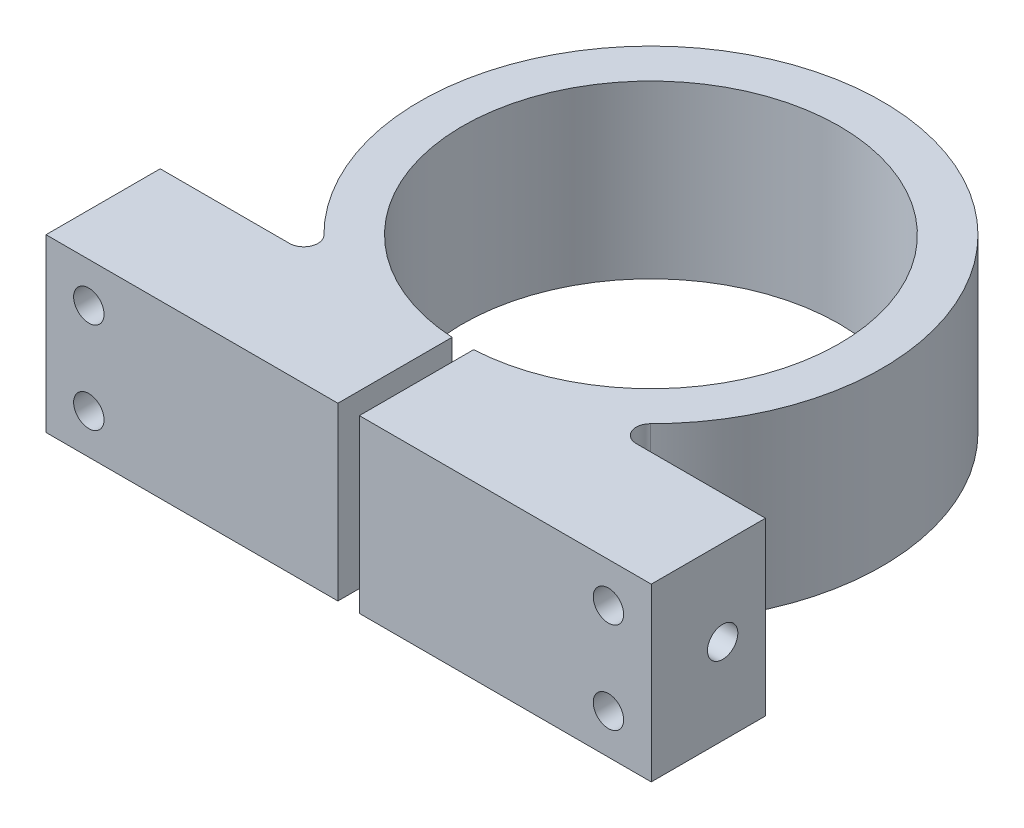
ISO-10303-21;
HEADER;
FILE_DESCRIPTION(('STEP AP214'),'2;1');
FILE_NAME('part.step','',(''),(''),'','','');
FILE_SCHEMA(('AUTOMOTIVE_DESIGN { 1 0 10303 214 1 1 1 1 }'));
ENDSEC;
DATA;
#1=APPLICATION_CONTEXT('core data for automotive mechanical design processes');
#2=APPLICATION_PROTOCOL_DEFINITION('international standard','automotive_design',2000,#1);
#3=PRODUCT_CONTEXT('',#1,'mechanical');
#4=PRODUCT('Part','Part','',(#3));
#5=PRODUCT_RELATED_PRODUCT_CATEGORY('part','',(#4));
#6=PRODUCT_DEFINITION_FORMATION('','',#4);
#7=PRODUCT_DEFINITION_CONTEXT('part definition',#1,'design');
#8=PRODUCT_DEFINITION('design','',#6,#7);
#9=PRODUCT_DEFINITION_SHAPE('','',#8);
#10=(LENGTH_UNIT() NAMED_UNIT(*) SI_UNIT(.MILLI.,.METRE.));
#11=(NAMED_UNIT(*) PLANE_ANGLE_UNIT() SI_UNIT($,.RADIAN.));
#12=(NAMED_UNIT(*) SI_UNIT($,.STERADIAN.) SOLID_ANGLE_UNIT());
#13=UNCERTAINTY_MEASURE_WITH_UNIT(LENGTH_MEASURE(1.E-05),#10,'distance_accuracy_value','');
#14=(GEOMETRIC_REPRESENTATION_CONTEXT(3) GLOBAL_UNCERTAINTY_ASSIGNED_CONTEXT((#13)) GLOBAL_UNIT_ASSIGNED_CONTEXT((#10,
#11,#12)) REPRESENTATION_CONTEXT('',''));
#15=CARTESIAN_POINT('',(0.,0.,0.));
#16=DIRECTION('',(0.,0.,1.));
#17=DIRECTION('',(1.,0.,0.));
#18=AXIS2_PLACEMENT_3D('',#15,#16,#17);
#19=CARTESIAN_POINT('',(-38.5631986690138,38.1,38.66693430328));
#20=DIRECTION('',(0.,-1.,0.));
#21=DIRECTION('',(0.,0.,-1.));
#22=AXIS2_PLACEMENT_3D('',#19,#20,#21);
#23=CYLINDRICAL_SURFACE('',#22,3.175);
#24=CARTESIAN_POINT('',(-38.5631986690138,0.,38.66693430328));
#25=DIRECTION('',(0.,-1.,0.));
#26=DIRECTION('',(0.,0.,1.));
#27=AXIS2_PLACEMENT_3D('',#24,#25,#26);
#28=CIRCLE('',#27,3.175);
#29=CARTESIAN_POINT('',(-36.3211522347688,0.,36.4188567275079));
#30=VERTEX_POINT('',#29);
#31=CARTESIAN_POINT('',(-38.5631986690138,0.,41.84193430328));
#32=VERTEX_POINT('',#31);
#33=EDGE_CURVE('E124',#30,#32,#28,.T.);
#34=ORIENTED_EDGE('',*,*,#33,.T.);
#35=DIRECTION('',(0.,-1.,0.));
#36=VECTOR('',#35,1.);
#37=CARTESIAN_POINT('',(-38.5631986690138,38.1,41.84193430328));
#38=LINE('',#37,#36);
#39=CARTESIAN_POINT('',(-38.5631986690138,38.1,41.84193430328));
#40=VERTEX_POINT('',#39);
#41=EDGE_CURVE('E11',#40,#32,#38,.T.);
#42=ORIENTED_EDGE('',*,*,#41,.F.);
#43=CARTESIAN_POINT('',(-38.5631986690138,38.1,38.66693430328));
#44=DIRECTION('',(0.,-1.,0.));
#45=DIRECTION('',(0.,0.,1.));
#46=AXIS2_PLACEMENT_3D('',#43,#44,#45);
#47=CIRCLE('',#46,3.175);
#48=CARTESIAN_POINT('',(-36.3211522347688,38.1,36.4188567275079));
#49=VERTEX_POINT('',#48);
#50=EDGE_CURVE('E164',#49,#40,#47,.T.);
#51=ORIENTED_EDGE('',*,*,#50,.F.);
#52=DIRECTION('',(0.,-1.,0.));
#53=VECTOR('',#52,1.);
#54=CARTESIAN_POINT('',(-36.3211522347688,38.1,36.4188567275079));
#55=LINE('',#54,#53);
#56=EDGE_CURVE('E137',#49,#30,#55,.T.);
#57=ORIENTED_EDGE('',*,*,#56,.T.);
#58=EDGE_LOOP('',(#34,#42,#51,#57));
#59=FACE_BOUND('',#58,.T.);
#60=ADVANCED_FACE('F32',(#59),#23,.F.);
#61=CARTESIAN_POINT('',(-67.31,38.1,41.84193430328));
#62=DIRECTION('',(0.,0.,1.));
#63=DIRECTION('',(1.,0.,0.));
#64=AXIS2_PLACEMENT_3D('',#61,#62,#63);
#65=PLANE('',#64);
#66=CARTESIAN_POINT('',(-57.785,8.89,41.84193430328));
#67=DIRECTION('',(0.,0.,-1.));
#68=DIRECTION('',(-1.,0.,0.));
#69=AXIS2_PLACEMENT_3D('',#66,#67,#68);
#70=CIRCLE('',#69,3.37819999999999);
#71=CARTESIAN_POINT('',(-61.1632,8.89,41.84193430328));
#72=VERTEX_POINT('',#71);
#73=EDGE_CURVE('E313',#72,#72,#70,.T.);
#74=ORIENTED_EDGE('',*,*,#73,.F.);
#75=EDGE_LOOP('',(#74));
#76=FACE_BOUND('',#75,.T.);
#77=CARTESIAN_POINT('',(-57.785,29.21,41.84193430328));
#78=DIRECTION('',(0.,0.,-1.));
#79=DIRECTION('',(-1.,0.,0.));
#80=AXIS2_PLACEMENT_3D('',#77,#78,#79);
#81=CIRCLE('',#80,3.37819999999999);
#82=CARTESIAN_POINT('',(-61.1632,29.21,41.84193430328));
#83=VERTEX_POINT('',#82);
#84=EDGE_CURVE('E310',#83,#83,#81,.T.);
#85=ORIENTED_EDGE('',*,*,#84,.F.);
#86=EDGE_LOOP('',(#85));
#87=FACE_BOUND('',#86,.T.);
#88=DIRECTION('',(-1.,0.,0.));
#89=VECTOR('',#88,1.);
#90=CARTESIAN_POINT('',(-67.31,0.,41.84193430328));
#91=LINE('',#90,#89);
#92=CARTESIAN_POINT('',(-67.31,0.,41.84193430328));
#93=VERTEX_POINT('',#92);
#94=EDGE_CURVE('E120',#32,#93,#91,.T.);
#95=ORIENTED_EDGE('',*,*,#94,.T.);
#96=DIRECTION('',(0.,-1.,0.));
#97=VECTOR('',#96,1.);
#98=CARTESIAN_POINT('',(-67.31,38.1,41.84193430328));
#99=LINE('',#98,#97);
#100=CARTESIAN_POINT('',(-67.31,38.1,41.84193430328));
#101=VERTEX_POINT('',#100);
#102=EDGE_CURVE('E39',#101,#93,#99,.T.);
#103=ORIENTED_EDGE('',*,*,#102,.F.);
#104=DIRECTION('',(-1.,0.,0.));
#105=VECTOR('',#104,1.);
#106=CARTESIAN_POINT('',(-67.31,38.1,41.84193430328));
#107=LINE('',#106,#105);
#108=EDGE_CURVE('E133',#40,#101,#107,.T.);
#109=ORIENTED_EDGE('',*,*,#108,.F.);
#110=ORIENTED_EDGE('',*,*,#41,.T.);
#111=EDGE_LOOP('',(#95,#103,#109,#110));
#112=FACE_BOUND('',#111,.T.);
#113=ADVANCED_FACE('F132',(#76,#87,#112),#65,.F.);
#114=CARTESIAN_POINT('',(-67.31,38.1,41.84193430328));
#115=DIRECTION('',(1.,0.,0.));
#116=DIRECTION('',(0.,0.,-1.));
#117=AXIS2_PLACEMENT_3D('',#114,#115,#116);
#118=PLANE('',#117);
#119=CARTESIAN_POINT('',(-67.31,19.05,51.36693430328));
#120=DIRECTION('',(-1.,0.,0.));
#121=DIRECTION('',(0.,0.,1.));
#122=AXIS2_PLACEMENT_3D('',#119,#120,#121);
#123=CIRCLE('',#122,3.37819999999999);
#124=CARTESIAN_POINT('',(-67.31,19.05,54.74513430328));
#125=VERTEX_POINT('',#124);
#126=EDGE_CURVE('E322',#125,#125,#123,.T.);
#127=ORIENTED_EDGE('',*,*,#126,.F.);
#128=EDGE_LOOP('',(#127));
#129=FACE_BOUND('',#128,.T.);
#130=DIRECTION('',(0.,0.,1.));
#131=VECTOR('',#130,1.);
#132=CARTESIAN_POINT('',(-67.31,0.,41.84193430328));
#133=LINE('',#132,#131);
#134=CARTESIAN_POINT('',(-67.31,0.,67.24193430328));
#135=VERTEX_POINT('',#134);
#136=EDGE_CURVE('E126',#93,#135,#133,.T.);
#137=ORIENTED_EDGE('',*,*,#136,.T.);
#138=DIRECTION('',(0.,-1.,0.));
#139=VECTOR('',#138,1.);
#140=CARTESIAN_POINT('',(-67.31,38.1,67.24193430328));
#141=LINE('',#140,#139);
#142=CARTESIAN_POINT('',(-67.31,38.1,67.24193430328));
#143=VERTEX_POINT('',#142);
#144=EDGE_CURVE('E210',#143,#135,#141,.T.);
#145=ORIENTED_EDGE('',*,*,#144,.F.);
#146=DIRECTION('',(0.,0.,1.));
#147=VECTOR('',#146,1.);
#148=CARTESIAN_POINT('',(-67.31,38.1,41.84193430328));
#149=LINE('',#148,#147);
#150=EDGE_CURVE('E167',#101,#143,#149,.T.);
#151=ORIENTED_EDGE('',*,*,#150,.F.);
#152=ORIENTED_EDGE('',*,*,#102,.T.);
#153=EDGE_LOOP('',(#137,#145,#151,#152));
#154=FACE_BOUND('',#153,.T.);
#155=ADVANCED_FACE('F214',(#129,#154),#118,.F.);
#156=CARTESIAN_POINT('',(-67.31,38.1,67.24193430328));
#157=DIRECTION('',(0.,0.,-1.));
#158=DIRECTION('',(-1.,0.,0.));
#159=AXIS2_PLACEMENT_3D('',#156,#157,#158);
#160=PLANE('',#159);
#161=CARTESIAN_POINT('',(-57.785,8.89,67.24193430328));
#162=DIRECTION('',(0.,0.,-1.));
#163=DIRECTION('',(-1.,0.,0.));
#164=AXIS2_PLACEMENT_3D('',#161,#162,#163);
#165=CIRCLE('',#164,3.3782);
#166=CARTESIAN_POINT('',(-61.1632,8.89,67.24193430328));
#167=VERTEX_POINT('',#166);
#168=EDGE_CURVE('E361',#167,#167,#165,.T.);
#169=ORIENTED_EDGE('',*,*,#168,.T.);
#170=EDGE_LOOP('',(#169));
#171=FACE_BOUND('',#170,.T.);
#172=CARTESIAN_POINT('',(-57.785,29.21,67.24193430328));
#173=DIRECTION('',(0.,0.,-1.));
#174=DIRECTION('',(-1.,0.,0.));
#175=AXIS2_PLACEMENT_3D('',#172,#173,#174);
#176=CIRCLE('',#175,3.3782);
#177=CARTESIAN_POINT('',(-61.1632,29.21,67.24193430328));
#178=VERTEX_POINT('',#177);
#179=EDGE_CURVE('E306',#178,#178,#176,.T.);
#180=ORIENTED_EDGE('',*,*,#179,.T.);
#181=EDGE_LOOP('',(#180));
#182=FACE_BOUND('',#181,.T.);
#183=DIRECTION('',(1.,0.,0.));
#184=VECTOR('',#183,1.);
#185=CARTESIAN_POINT('',(-67.31,0.,67.24193430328));
#186=LINE('',#185,#184);
#187=CARTESIAN_POINT('',(-2.3876,0.,67.24193430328));
#188=VERTEX_POINT('',#187);
#189=EDGE_CURVE('E146',#135,#188,#186,.T.);
#190=ORIENTED_EDGE('',*,*,#189,.T.);
#191=DIRECTION('',(0.,-1.,0.));
#192=VECTOR('',#191,1.);
#193=CARTESIAN_POINT('',(-2.3876,38.1,67.24193430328));
#194=LINE('',#193,#192);
#195=CARTESIAN_POINT('',(-2.3876,38.1,67.24193430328));
#196=VERTEX_POINT('',#195);
#197=EDGE_CURVE('E207',#196,#188,#194,.T.);
#198=ORIENTED_EDGE('',*,*,#197,.F.);
#199=DIRECTION('',(1.,0.,0.));
#200=VECTOR('',#199,1.);
#201=CARTESIAN_POINT('',(-67.31,38.1,67.24193430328));
#202=LINE('',#201,#200);
#203=EDGE_CURVE('E169',#143,#196,#202,.T.);
#204=ORIENTED_EDGE('',*,*,#203,.F.);
#205=ORIENTED_EDGE('',*,*,#144,.T.);
#206=EDGE_LOOP('',(#190,#198,#204,#205));
#207=FACE_BOUND('',#206,.T.);
#208=ADVANCED_FACE('F222',(#171,#182,#207),#160,.F.);
#209=CARTESIAN_POINT('',(-2.3876,38.1,67.24193430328));
#210=DIRECTION('',(-1.,0.,0.));
#211=DIRECTION('',(0.,0.,1.));
#212=AXIS2_PLACEMENT_3D('',#209,#210,#211);
#213=PLANE('',#212);
#214=CARTESIAN_POINT('',(-2.3876,19.05,51.36693430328));
#215=DIRECTION('',(-1.,0.,0.));
#216=DIRECTION('',(0.,0.,1.));
#217=AXIS2_PLACEMENT_3D('',#214,#215,#216);
#218=CIRCLE('',#217,3.37819999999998);
#219=CARTESIAN_POINT('',(-2.3876,19.05,54.74513430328));
#220=VERTEX_POINT('',#219);
#221=EDGE_CURVE('E138',#220,#220,#218,.T.);
#222=ORIENTED_EDGE('',*,*,#221,.T.);
#223=EDGE_LOOP('',(#222));
#224=FACE_BOUND('',#223,.T.);
#225=DIRECTION('',(0.,0.,-1.));
#226=VECTOR('',#225,1.);
#227=CARTESIAN_POINT('',(-2.3876,0.,67.24193430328));
#228=LINE('',#227,#226);
#229=CARTESIAN_POINT('',(-2.3876,0.,41.84193430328));
#230=VERTEX_POINT('',#229);
#231=EDGE_CURVE('E148',#188,#230,#228,.T.);
#232=ORIENTED_EDGE('',*,*,#231,.T.);
#233=DIRECTION('',(0.,-1.,0.));
#234=VECTOR('',#233,1.);
#235=CARTESIAN_POINT('',(-2.3876,38.1,41.84193430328));
#236=LINE('',#235,#234);
#237=CARTESIAN_POINT('',(-2.3876,38.1,41.84193430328));
#238=VERTEX_POINT('',#237);
#239=EDGE_CURVE('E204',#238,#230,#236,.T.);
#240=ORIENTED_EDGE('',*,*,#239,.F.);
#241=DIRECTION('',(0.,0.,-1.));
#242=VECTOR('',#241,1.);
#243=CARTESIAN_POINT('',(-2.3876,38.1,67.24193430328));
#244=LINE('',#243,#242);
#245=EDGE_CURVE('E171',#196,#238,#244,.T.);
#246=ORIENTED_EDGE('',*,*,#245,.F.);
#247=ORIENTED_EDGE('',*,*,#197,.T.);
#248=EDGE_LOOP('',(#232,#240,#246,#247));
#249=FACE_BOUND('',#248,.T.);
#250=ADVANCED_FACE('F225',(#224,#249),#213,.F.);
#251=CARTESIAN_POINT('',(0.,38.1,0.));
#252=DIRECTION('',(0.,-1.,0.));
#253=DIRECTION('',(0.,0.,-1.));
#254=AXIS2_PLACEMENT_3D('',#251,#252,#253);
#255=CYLINDRICAL_SURFACE('',#254,41.91);
#256=CARTESIAN_POINT('',(0.,0.,0.));
#257=DIRECTION('',(0.,-1.,0.));
#258=DIRECTION('',(0.,0.,1.));
#259=AXIS2_PLACEMENT_3D('',#256,#257,#258);
#260=CIRCLE('',#259,41.91);
#261=CARTESIAN_POINT('',(2.3876,0.,41.84193430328));
#262=VERTEX_POINT('',#261);
#263=EDGE_CURVE('E150',#230,#262,#260,.T.);
#264=ORIENTED_EDGE('',*,*,#263,.T.);
#265=DIRECTION('',(0.,-1.,0.));
#266=VECTOR('',#265,1.);
#267=CARTESIAN_POINT('',(2.3876,38.1,41.84193430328));
#268=LINE('',#267,#266);
#269=CARTESIAN_POINT('',(2.3876,38.1,41.84193430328));
#270=VERTEX_POINT('',#269);
#271=EDGE_CURVE('E201',#270,#262,#268,.T.);
#272=ORIENTED_EDGE('',*,*,#271,.F.);
#273=CARTESIAN_POINT('',(0.,38.1,0.));
#274=DIRECTION('',(0.,-1.,0.));
#275=DIRECTION('',(0.,0.,1.));
#276=AXIS2_PLACEMENT_3D('',#273,#274,#275);
#277=CIRCLE('',#276,41.91);
#278=EDGE_CURVE('E173',#238,#270,#277,.T.);
#279=ORIENTED_EDGE('',*,*,#278,.F.);
#280=ORIENTED_EDGE('',*,*,#239,.T.);
#281=EDGE_LOOP('',(#264,#272,#279,#280));
#282=FACE_BOUND('',#281,.T.);
#283=ADVANCED_FACE('F230',(#282),#255,.F.);
#284=CARTESIAN_POINT('',(2.3876,38.1,67.24193430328));
#285=DIRECTION('',(1.,0.,0.));
#286=DIRECTION('',(0.,0.,-1.));
#287=AXIS2_PLACEMENT_3D('',#284,#285,#286);
#288=PLANE('',#287);
#289=CARTESIAN_POINT('',(2.3876,19.05,51.36693430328));
#290=DIRECTION('',(1.,0.,0.));
#291=DIRECTION('',(0.,0.,-1.));
#292=AXIS2_PLACEMENT_3D('',#289,#290,#291);
#293=CIRCLE('',#292,3.37819999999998);
#294=CARTESIAN_POINT('',(2.3876,19.05,47.98873430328));
#295=VERTEX_POINT('',#294);
#296=EDGE_CURVE('E141',#295,#295,#293,.T.);
#297=ORIENTED_EDGE('',*,*,#296,.T.);
#298=EDGE_LOOP('',(#297));
#299=FACE_BOUND('',#298,.T.);
#300=DIRECTION('',(0.,0.,1.));
#301=VECTOR('',#300,1.);
#302=CARTESIAN_POINT('',(2.3876,0.,67.24193430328));
#303=LINE('',#302,#301);
#304=CARTESIAN_POINT('',(2.3876,0.,67.24193430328));
#305=VERTEX_POINT('',#304);
#306=EDGE_CURVE('E152',#262,#305,#303,.T.);
#307=ORIENTED_EDGE('',*,*,#306,.T.);
#308=DIRECTION('',(0.,-1.,0.));
#309=VECTOR('',#308,1.);
#310=CARTESIAN_POINT('',(2.3876,38.1,67.24193430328));
#311=LINE('',#310,#309);
#312=CARTESIAN_POINT('',(2.3876,38.1,67.24193430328));
#313=VERTEX_POINT('',#312);
#314=EDGE_CURVE('E198',#313,#305,#311,.T.);
#315=ORIENTED_EDGE('',*,*,#314,.F.);
#316=DIRECTION('',(0.,0.,1.));
#317=VECTOR('',#316,1.);
#318=CARTESIAN_POINT('',(2.3876,38.1,67.24193430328));
#319=LINE('',#318,#317);
#320=EDGE_CURVE('E175',#270,#313,#319,.T.);
#321=ORIENTED_EDGE('',*,*,#320,.F.);
#322=ORIENTED_EDGE('',*,*,#271,.T.);
#323=EDGE_LOOP('',(#307,#315,#321,#322));
#324=FACE_BOUND('',#323,.T.);
#325=ADVANCED_FACE('F236',(#299,#324),#288,.F.);
#326=CARTESIAN_POINT('',(2.3876,38.1,67.24193430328));
#327=DIRECTION('',(0.,0.,-1.));
#328=DIRECTION('',(-1.,0.,0.));
#329=AXIS2_PLACEMENT_3D('',#326,#327,#328);
#330=PLANE('',#329);
#331=CARTESIAN_POINT('',(57.785,8.89,67.24193430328));
#332=DIRECTION('',(0.,0.,-1.));
#333=DIRECTION('',(-1.,0.,0.));
#334=AXIS2_PLACEMENT_3D('',#331,#332,#333);
#335=CIRCLE('',#334,3.3782);
#336=CARTESIAN_POINT('',(54.4068,8.89,67.24193430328));
#337=VERTEX_POINT('',#336);
#338=EDGE_CURVE('E360',#337,#337,#335,.T.);
#339=ORIENTED_EDGE('',*,*,#338,.T.);
#340=EDGE_LOOP('',(#339));
#341=FACE_BOUND('',#340,.T.);
#342=CARTESIAN_POINT('',(57.785,29.21,67.24193430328));
#343=DIRECTION('',(0.,0.,-1.));
#344=DIRECTION('',(-1.,0.,0.));
#345=AXIS2_PLACEMENT_3D('',#342,#343,#344);
#346=CIRCLE('',#345,3.3782);
#347=CARTESIAN_POINT('',(54.4068,29.21,67.24193430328));
#348=VERTEX_POINT('',#347);
#349=EDGE_CURVE('E307',#348,#348,#346,.T.);
#350=ORIENTED_EDGE('',*,*,#349,.T.);
#351=EDGE_LOOP('',(#350));
#352=FACE_BOUND('',#351,.T.);
#353=DIRECTION('',(1.,0.,0.));
#354=VECTOR('',#353,1.);
#355=CARTESIAN_POINT('',(2.3876,0.,67.24193430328));
#356=LINE('',#355,#354);
#357=CARTESIAN_POINT('',(67.31,0.,67.24193430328));
#358=VERTEX_POINT('',#357);
#359=EDGE_CURVE('E154',#305,#358,#356,.T.);
#360=ORIENTED_EDGE('',*,*,#359,.T.);
#361=DIRECTION('',(0.,-1.,0.));
#362=VECTOR('',#361,1.);
#363=CARTESIAN_POINT('',(67.31,38.1,67.24193430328));
#364=LINE('',#363,#362);
#365=CARTESIAN_POINT('',(67.31,38.1,67.24193430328));
#366=VERTEX_POINT('',#365);
#367=EDGE_CURVE('E195',#366,#358,#364,.T.);
#368=ORIENTED_EDGE('',*,*,#367,.F.);
#369=DIRECTION('',(1.,0.,0.));
#370=VECTOR('',#369,1.);
#371=CARTESIAN_POINT('',(2.3876,38.1,67.24193430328));
#372=LINE('',#371,#370);
#373=EDGE_CURVE('E177',#313,#366,#372,.T.);
#374=ORIENTED_EDGE('',*,*,#373,.F.);
#375=ORIENTED_EDGE('',*,*,#314,.T.);
#376=EDGE_LOOP('',(#360,#368,#374,#375));
#377=FACE_BOUND('',#376,.T.);
#378=ADVANCED_FACE('F240',(#341,#352,#377),#330,.F.);
#379=CARTESIAN_POINT('',(67.31,38.1,41.84193430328));
#380=DIRECTION('',(-1.,0.,0.));
#381=DIRECTION('',(0.,0.,1.));
#382=AXIS2_PLACEMENT_3D('',#379,#380,#381);
#383=PLANE('',#382);
#384=CARTESIAN_POINT('',(67.3100000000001,19.05,51.3669343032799));
#385=DIRECTION('',(-1.,0.,0.));
#386=DIRECTION('',(0.,0.,1.));
#387=AXIS2_PLACEMENT_3D('',#384,#385,#386);
#388=CIRCLE('',#387,3.37819999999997);
#389=CARTESIAN_POINT('',(67.3100000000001,19.05,54.7451343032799));
#390=VERTEX_POINT('',#389);
#391=EDGE_CURVE('E319',#390,#390,#388,.T.);
#392=ORIENTED_EDGE('',*,*,#391,.T.);
#393=EDGE_LOOP('',(#392));
#394=FACE_BOUND('',#393,.T.);
#395=DIRECTION('',(0.,0.,-1.));
#396=VECTOR('',#395,1.);
#397=CARTESIAN_POINT('',(67.31,0.,41.84193430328));
#398=LINE('',#397,#396);
#399=CARTESIAN_POINT('',(67.31,0.,41.84193430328));
#400=VERTEX_POINT('',#399);
#401=EDGE_CURVE('E156',#358,#400,#398,.T.);
#402=ORIENTED_EDGE('',*,*,#401,.T.);
#403=DIRECTION('',(0.,-1.,0.));
#404=VECTOR('',#403,1.);
#405=CARTESIAN_POINT('',(67.31,38.1,41.84193430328));
#406=LINE('',#405,#404);
#407=CARTESIAN_POINT('',(67.31,38.1,41.84193430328));
#408=VERTEX_POINT('',#407);
#409=EDGE_CURVE('E192',#408,#400,#406,.T.);
#410=ORIENTED_EDGE('',*,*,#409,.F.);
#411=DIRECTION('',(0.,0.,-1.));
#412=VECTOR('',#411,1.);
#413=CARTESIAN_POINT('',(67.31,38.1,41.84193430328));
#414=LINE('',#413,#412);
#415=EDGE_CURVE('E179',#366,#408,#414,.T.);
#416=ORIENTED_EDGE('',*,*,#415,.F.);
#417=ORIENTED_EDGE('',*,*,#367,.T.);
#418=EDGE_LOOP('',(#402,#410,#416,#417));
#419=FACE_BOUND('',#418,.T.);
#420=ADVANCED_FACE('F245',(#394,#419),#383,.F.);
#421=CARTESIAN_POINT('',(38.5631986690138,38.1,41.84193430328));
#422=DIRECTION('',(0.,0.,1.));
#423=DIRECTION('',(1.,0.,0.));
#424=AXIS2_PLACEMENT_3D('',#421,#422,#423);
#425=PLANE('',#424);
#426=CARTESIAN_POINT('',(57.785,8.89,41.84193430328));
#427=DIRECTION('',(0.,0.,-1.));
#428=DIRECTION('',(-1.,0.,0.));
#429=AXIS2_PLACEMENT_3D('',#426,#427,#428);
#430=CIRCLE('',#429,3.37819999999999);
#431=CARTESIAN_POINT('',(54.4068,8.89,41.84193430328));
#432=VERTEX_POINT('',#431);
#433=EDGE_CURVE('E301',#432,#432,#430,.T.);
#434=ORIENTED_EDGE('',*,*,#433,.F.);
#435=EDGE_LOOP('',(#434));
#436=FACE_BOUND('',#435,.T.);
#437=CARTESIAN_POINT('',(57.785,29.21,41.84193430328));
#438=DIRECTION('',(0.,0.,-1.));
#439=DIRECTION('',(-1.,0.,0.));
#440=AXIS2_PLACEMENT_3D('',#437,#438,#439);
#441=CIRCLE('',#440,3.37819999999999);
#442=CARTESIAN_POINT('',(54.4068,29.21,41.84193430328));
#443=VERTEX_POINT('',#442);
#444=EDGE_CURVE('E304',#443,#443,#441,.T.);
#445=ORIENTED_EDGE('',*,*,#444,.F.);
#446=EDGE_LOOP('',(#445));
#447=FACE_BOUND('',#446,.T.);
#448=DIRECTION('',(-1.,0.,0.));
#449=VECTOR('',#448,1.);
#450=CARTESIAN_POINT('',(38.5631986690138,0.,41.84193430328));
#451=LINE('',#450,#449);
#452=CARTESIAN_POINT('',(38.5631986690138,0.,41.84193430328));
#453=VERTEX_POINT('',#452);
#454=EDGE_CURVE('E158',#400,#453,#451,.T.);
#455=ORIENTED_EDGE('',*,*,#454,.T.);
#456=DIRECTION('',(0.,-1.,0.));
#457=VECTOR('',#456,1.);
#458=CARTESIAN_POINT('',(38.5631986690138,38.1,41.84193430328));
#459=LINE('',#458,#457);
#460=CARTESIAN_POINT('',(38.5631986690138,38.1,41.84193430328));
#461=VERTEX_POINT('',#460);
#462=EDGE_CURVE('E189',#461,#453,#459,.T.);
#463=ORIENTED_EDGE('',*,*,#462,.F.);
#464=DIRECTION('',(-1.,0.,0.));
#465=VECTOR('',#464,1.);
#466=CARTESIAN_POINT('',(38.5631986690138,38.1,41.84193430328));
#467=LINE('',#466,#465);
#468=EDGE_CURVE('E181',#408,#461,#467,.T.);
#469=ORIENTED_EDGE('',*,*,#468,.F.);
#470=ORIENTED_EDGE('',*,*,#409,.T.);
#471=EDGE_LOOP('',(#455,#463,#469,#470));
#472=FACE_BOUND('',#471,.T.);
#473=ADVANCED_FACE('F249',(#436,#447,#472),#425,.F.);
#474=CARTESIAN_POINT('',(38.5631986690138,38.1,38.66693430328));
#475=DIRECTION('',(0.,-1.,0.));
#476=DIRECTION('',(0.,0.,-1.));
#477=AXIS2_PLACEMENT_3D('',#474,#475,#476);
#478=CYLINDRICAL_SURFACE('',#477,3.175);
#479=CARTESIAN_POINT('',(38.5631986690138,0.,38.66693430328));
#480=DIRECTION('',(0.,-1.,0.));
#481=DIRECTION('',(0.,0.,1.));
#482=AXIS2_PLACEMENT_3D('',#479,#480,#481);
#483=CIRCLE('',#482,3.175);
#484=CARTESIAN_POINT('',(36.3211522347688,0.,36.4188567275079));
#485=VERTEX_POINT('',#484);
#486=EDGE_CURVE('E160',#453,#485,#483,.T.);
#487=ORIENTED_EDGE('',*,*,#486,.T.);
#488=DIRECTION('',(0.,-1.,0.));
#489=VECTOR('',#488,1.);
#490=CARTESIAN_POINT('',(36.3211522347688,38.1,36.4188567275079));
#491=LINE('',#490,#489);
#492=CARTESIAN_POINT('',(36.3211522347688,38.1,36.4188567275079));
#493=VERTEX_POINT('',#492);
#494=EDGE_CURVE('E186',#493,#485,#491,.T.);
#495=ORIENTED_EDGE('',*,*,#494,.F.);
#496=CARTESIAN_POINT('',(38.5631986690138,38.1,38.66693430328));
#497=DIRECTION('',(0.,-1.,0.));
#498=DIRECTION('',(0.,0.,1.));
#499=AXIS2_PLACEMENT_3D('',#496,#497,#498);
#500=CIRCLE('',#499,3.175);
#501=EDGE_CURVE('E51',#461,#493,#500,.T.);
#502=ORIENTED_EDGE('',*,*,#501,.F.);
#503=ORIENTED_EDGE('',*,*,#462,.T.);
#504=EDGE_LOOP('',(#487,#495,#502,#503));
#505=FACE_BOUND('',#504,.T.);
#506=ADVANCED_FACE('F253',(#505),#478,.F.);
#507=CARTESIAN_POINT('',(0.,38.1,0.));
#508=DIRECTION('',(0.,-1.,0.));
#509=DIRECTION('',(0.,0.,-1.));
#510=AXIS2_PLACEMENT_3D('',#507,#508,#509);
#511=CYLINDRICAL_SURFACE('',#510,51.435);
#512=CARTESIAN_POINT('',(0.,0.,0.));
#513=DIRECTION('',(0.,1.,0.));
#514=DIRECTION('',(0.,0.,1.));
#515=AXIS2_PLACEMENT_3D('',#512,#513,#514);
#516=CIRCLE('',#515,51.435);
#517=EDGE_CURVE('E162',#485,#30,#516,.T.);
#518=ORIENTED_EDGE('',*,*,#517,.T.);
#519=ORIENTED_EDGE('',*,*,#56,.F.);
#520=CARTESIAN_POINT('',(0.,38.1,0.));
#521=DIRECTION('',(0.,1.,0.));
#522=DIRECTION('',(0.,0.,1.));
#523=AXIS2_PLACEMENT_3D('',#520,#521,#522);
#524=CIRCLE('',#523,51.435);
#525=EDGE_CURVE('E46',#493,#49,#524,.T.);
#526=ORIENTED_EDGE('',*,*,#525,.F.);
#527=ORIENTED_EDGE('',*,*,#494,.T.);
#528=EDGE_LOOP('',(#518,#519,#526,#527));
#529=FACE_BOUND('',#528,.T.);
#530=ADVANCED_FACE('F255',(#529),#511,.T.);
#531=CARTESIAN_POINT('',(-38.5631986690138,38.1,38.66693430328));
#532=DIRECTION('',(0.,1.,0.));
#533=DIRECTION('',(0.,0.,1.));
#534=AXIS2_PLACEMENT_3D('',#531,#532,#533);
#535=PLANE('',#534);
#536=ORIENTED_EDGE('',*,*,#50,.T.);
#537=ORIENTED_EDGE('',*,*,#108,.T.);
#538=ORIENTED_EDGE('',*,*,#150,.T.);
#539=ORIENTED_EDGE('',*,*,#203,.T.);
#540=ORIENTED_EDGE('',*,*,#245,.T.);
#541=ORIENTED_EDGE('',*,*,#278,.T.);
#542=ORIENTED_EDGE('',*,*,#320,.T.);
#543=ORIENTED_EDGE('',*,*,#373,.T.);
#544=ORIENTED_EDGE('',*,*,#415,.T.);
#545=ORIENTED_EDGE('',*,*,#468,.T.);
#546=ORIENTED_EDGE('',*,*,#501,.T.);
#547=ORIENTED_EDGE('',*,*,#525,.T.);
#548=EDGE_LOOP('',(#536,#537,#538,#539,#540,#541,#542,#543,#544,#545,#546,#547));
#549=FACE_BOUND('',#548,.T.);
#550=ADVANCED_FACE('F217',(#549),#535,.T.);
#551=CARTESIAN_POINT('',(-38.5631986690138,0.,38.66693430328));
#552=DIRECTION('',(0.,1.,0.));
#553=DIRECTION('',(0.,0.,1.));
#554=AXIS2_PLACEMENT_3D('',#551,#552,#553);
#555=PLANE('',#554);
#556=ORIENTED_EDGE('',*,*,#33,.F.);
#557=ORIENTED_EDGE('',*,*,#517,.F.);
#558=ORIENTED_EDGE('',*,*,#486,.F.);
#559=ORIENTED_EDGE('',*,*,#454,.F.);
#560=ORIENTED_EDGE('',*,*,#401,.F.);
#561=ORIENTED_EDGE('',*,*,#359,.F.);
#562=ORIENTED_EDGE('',*,*,#306,.F.);
#563=ORIENTED_EDGE('',*,*,#263,.F.);
#564=ORIENTED_EDGE('',*,*,#231,.F.);
#565=ORIENTED_EDGE('',*,*,#189,.F.);
#566=ORIENTED_EDGE('',*,*,#136,.F.);
#567=ORIENTED_EDGE('',*,*,#94,.F.);
#568=EDGE_LOOP('',(#556,#557,#558,#559,#560,#561,#562,#563,#564,#565,#566,#567));
#569=FACE_BOUND('',#568,.T.);
#570=ADVANCED_FACE('F121',(#569),#555,.F.);
#571=CARTESIAN_POINT('',(-67.31,19.05,51.36693430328));
#572=DIRECTION('',(-1.,0.,0.));
#573=DIRECTION('',(0.,0.,1.));
#574=AXIS2_PLACEMENT_3D('',#571,#572,#573);
#575=CYLINDRICAL_SURFACE('',#574,3.37819999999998);
#576=ORIENTED_EDGE('',*,*,#391,.F.);
#577=EDGE_LOOP('',(#576));
#578=FACE_BOUND('',#577,.T.);
#579=ORIENTED_EDGE('',*,*,#296,.F.);
#580=EDGE_LOOP('',(#579));
#581=FACE_BOUND('',#580,.T.);
#582=ADVANCED_FACE('F327',(#578,#581),#575,.F.);
#583=ORIENTED_EDGE('',*,*,#126,.T.);
#584=EDGE_LOOP('',(#583));
#585=FACE_BOUND('',#584,.T.);
#586=ORIENTED_EDGE('',*,*,#221,.F.);
#587=EDGE_LOOP('',(#586));
#588=FACE_BOUND('',#587,.T.);
#589=ADVANCED_FACE('F329',(#585,#588),#575,.F.);
#590=CARTESIAN_POINT('',(-57.785,29.21,41.84193430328));
#591=DIRECTION('',(0.,0.,-1.));
#592=DIRECTION('',(-1.,0.,0.));
#593=AXIS2_PLACEMENT_3D('',#590,#591,#592);
#594=CYLINDRICAL_SURFACE('',#593,3.37819999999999);
#595=ORIENTED_EDGE('',*,*,#179,.F.);
#596=EDGE_LOOP('',(#595));
#597=FACE_BOUND('',#596,.T.);
#598=ORIENTED_EDGE('',*,*,#84,.T.);
#599=EDGE_LOOP('',(#598));
#600=FACE_BOUND('',#599,.T.);
#601=ADVANCED_FACE('F336',(#597,#600),#594,.F.);
#602=CARTESIAN_POINT('',(57.785,29.21,41.84193430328));
#603=DIRECTION('',(0.,0.,-1.));
#604=DIRECTION('',(-1.,0.,0.));
#605=AXIS2_PLACEMENT_3D('',#602,#603,#604);
#606=CYLINDRICAL_SURFACE('',#605,3.37819999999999);
#607=ORIENTED_EDGE('',*,*,#349,.F.);
#608=EDGE_LOOP('',(#607));
#609=FACE_BOUND('',#608,.T.);
#610=ORIENTED_EDGE('',*,*,#444,.T.);
#611=EDGE_LOOP('',(#610));
#612=FACE_BOUND('',#611,.T.);
#613=ADVANCED_FACE('F343',(#609,#612),#606,.F.);
#614=CARTESIAN_POINT('',(-57.785,8.89,41.84193430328));
#615=DIRECTION('',(0.,0.,-1.));
#616=DIRECTION('',(-1.,0.,0.));
#617=AXIS2_PLACEMENT_3D('',#614,#615,#616);
#618=CYLINDRICAL_SURFACE('',#617,3.37819999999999);
#619=ORIENTED_EDGE('',*,*,#168,.F.);
#620=EDGE_LOOP('',(#619));
#621=FACE_BOUND('',#620,.T.);
#622=ORIENTED_EDGE('',*,*,#73,.T.);
#623=EDGE_LOOP('',(#622));
#624=FACE_BOUND('',#623,.T.);
#625=ADVANCED_FACE('F347',(#621,#624),#618,.F.);
#626=CARTESIAN_POINT('',(57.785,8.89,41.84193430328));
#627=DIRECTION('',(0.,0.,-1.));
#628=DIRECTION('',(-1.,0.,0.));
#629=AXIS2_PLACEMENT_3D('',#626,#627,#628);
#630=CYLINDRICAL_SURFACE('',#629,3.37819999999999);
#631=ORIENTED_EDGE('',*,*,#338,.F.);
#632=EDGE_LOOP('',(#631));
#633=FACE_BOUND('',#632,.T.);
#634=ORIENTED_EDGE('',*,*,#433,.T.);
#635=EDGE_LOOP('',(#634));
#636=FACE_BOUND('',#635,.T.);
#637=ADVANCED_FACE('F351',(#633,#636),#630,.F.);
#638=CLOSED_SHELL('',(#60,#113,#155,#208,#250,#283,#325,#378,#420,#473,#506,#530,#550,#570,#582,
#589,#601,#613,#625,#637));
#639=MANIFOLD_SOLID_BREP('B2',#638);
#640=ADVANCED_BREP_SHAPE_REPRESENTATION('',(#18,#639),#14);
#641=SHAPE_DEFINITION_REPRESENTATION(#9,#640);
ENDSEC;
END-ISO-10303-21;
